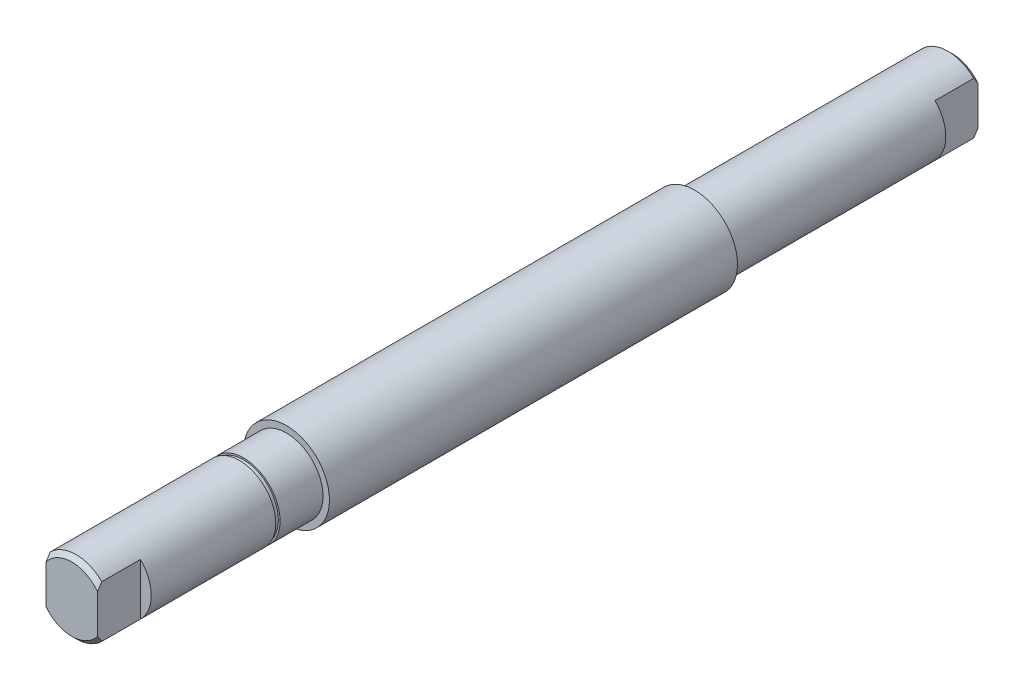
ISO-10303-21;
HEADER;
FILE_DESCRIPTION(('STEP AP214'),'2;1');
FILE_NAME('part.step','',(''),(''),'','','');
FILE_SCHEMA(('AUTOMOTIVE_DESIGN { 1 0 10303 214 1 1 1 1 }'));
ENDSEC;
DATA;
#1=APPLICATION_CONTEXT('core data for automotive mechanical design processes');
#2=APPLICATION_PROTOCOL_DEFINITION('international standard','automotive_design',2000,#1);
#3=PRODUCT_CONTEXT('',#1,'mechanical');
#4=PRODUCT('Part','Part','',(#3));
#5=PRODUCT_RELATED_PRODUCT_CATEGORY('part','',(#4));
#6=PRODUCT_DEFINITION_FORMATION('','',#4);
#7=PRODUCT_DEFINITION_CONTEXT('part definition',#1,'design');
#8=PRODUCT_DEFINITION('design','',#6,#7);
#9=PRODUCT_DEFINITION_SHAPE('','',#8);
#10=(LENGTH_UNIT() NAMED_UNIT(*) SI_UNIT(.MILLI.,.METRE.));
#11=(NAMED_UNIT(*) PLANE_ANGLE_UNIT() SI_UNIT($,.RADIAN.));
#12=(NAMED_UNIT(*) SI_UNIT($,.STERADIAN.) SOLID_ANGLE_UNIT());
#13=UNCERTAINTY_MEASURE_WITH_UNIT(LENGTH_MEASURE(1.E-05),#10,'distance_accuracy_value','');
#14=(GEOMETRIC_REPRESENTATION_CONTEXT(3) GLOBAL_UNCERTAINTY_ASSIGNED_CONTEXT((#13)) GLOBAL_UNIT_ASSIGNED_CONTEXT((#10,
#11,#12)) REPRESENTATION_CONTEXT('',''));
#15=CARTESIAN_POINT('',(0.,0.,0.));
#16=DIRECTION('',(0.,0.,1.));
#17=DIRECTION('',(1.,0.,0.));
#18=AXIS2_PLACEMENT_3D('',#15,#16,#17);
#19=CARTESIAN_POINT('',(0.,0.,205.));
#20=DIRECTION('',(0.,0.,-1.));
#21=DIRECTION('',(-1.,0.,0.));
#22=AXIS2_PLACEMENT_3D('',#19,#20,#21);
#23=CYLINDRICAL_SURFACE('',#22,8.5);
#24=CARTESIAN_POINT('',(0.,0.,155.));
#25=DIRECTION('',(0.,0.,1.));
#26=DIRECTION('',(1.,0.,0.));
#27=AXIS2_PLACEMENT_3D('',#24,#25,#26);
#28=CIRCLE('',#27,8.5);
#29=CARTESIAN_POINT('',(8.5,0.,155.));
#30=VERTEX_POINT('',#29);
#31=EDGE_CURVE('E193',#30,#30,#28,.T.);
#32=ORIENTED_EDGE('',*,*,#31,.T.);
#33=EDGE_LOOP('',(#32));
#34=FACE_BOUND('',#33,.T.);
#35=CARTESIAN_POINT('',(0.,0.,165.));
#36=DIRECTION('',(0.,0.,1.));
#37=DIRECTION('',(1.,0.,0.));
#38=AXIS2_PLACEMENT_3D('',#35,#36,#37);
#39=CIRCLE('',#38,8.5);
#40=CARTESIAN_POINT('',(8.5,0.,165.));
#41=VERTEX_POINT('',#40);
#42=EDGE_CURVE('E187',#41,#41,#39,.T.);
#43=ORIENTED_EDGE('',*,*,#42,.F.);
#44=EDGE_LOOP('',(#43));
#45=FACE_BOUND('',#44,.T.);
#46=ADVANCED_FACE('F29',(#34,#45),#23,.T.);
#47=CARTESIAN_POINT('',(0.,0.,155.));
#48=DIRECTION('',(0.,0.,1.));
#49=DIRECTION('',(1.,0.,0.));
#50=AXIS2_PLACEMENT_3D('',#47,#48,#49);
#51=PLANE('',#50);
#52=CARTESIAN_POINT('',(0.,0.,155.));
#53=DIRECTION('',(0.,0.,1.));
#54=DIRECTION('',(1.,0.,0.));
#55=AXIS2_PLACEMENT_3D('',#52,#53,#54);
#56=CIRCLE('',#55,10.);
#57=CARTESIAN_POINT('',(10.,0.,155.));
#58=VERTEX_POINT('',#57);
#59=EDGE_CURVE('E199',#58,#58,#56,.T.);
#60=ORIENTED_EDGE('',*,*,#59,.T.);
#61=EDGE_LOOP('',(#60));
#62=FACE_BOUND('',#61,.T.);
#63=ORIENTED_EDGE('',*,*,#31,.F.);
#64=EDGE_LOOP('',(#63));
#65=FACE_BOUND('',#64,.T.);
#66=ADVANCED_FACE('F309',(#62,#65),#51,.T.);
#67=CARTESIAN_POINT('',(0.,0.,60.));
#68=DIRECTION('',(0.,0.,-1.));
#69=DIRECTION('',(-1.,0.,0.));
#70=AXIS2_PLACEMENT_3D('',#67,#68,#69);
#71=CYLINDRICAL_SURFACE('',#70,8.5);
#72=CARTESIAN_POINT('',(0.,0.,60.));
#73=DIRECTION('',(0.,0.,1.));
#74=DIRECTION('',(1.,0.,0.));
#75=AXIS2_PLACEMENT_3D('',#72,#73,#74);
#76=CIRCLE('',#75,8.5);
#77=CARTESIAN_POINT('',(8.5,0.,60.));
#78=VERTEX_POINT('',#77);
#79=EDGE_CURVE('E202',#78,#78,#76,.T.);
#80=ORIENTED_EDGE('',*,*,#79,.F.);
#81=EDGE_LOOP('',(#80));
#82=FACE_BOUND('',#81,.T.);
#83=DIRECTION('',(0.,0.,-1.));
#84=VECTOR('',#83,1.);
#85=CARTESIAN_POINT('',(6.,6.02079728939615,10.));
#86=LINE('',#85,#84);
#87=CARTESIAN_POINT('',(6.,6.02079728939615,10.));
#88=VERTEX_POINT('',#87);
#89=CARTESIAN_POINT('',(6.,6.02079728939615,1.));
#90=VERTEX_POINT('',#89);
#91=EDGE_CURVE('E133',#88,#90,#86,.T.);
#92=ORIENTED_EDGE('',*,*,#91,.T.);
#93=CARTESIAN_POINT('',(0.,0.,1.));
#94=DIRECTION('',(0.,0.,1.));
#95=DIRECTION('',(1.,0.,0.));
#96=AXIS2_PLACEMENT_3D('',#93,#94,#95);
#97=CIRCLE('',#96,8.5);
#98=CARTESIAN_POINT('',(-6.,6.02079728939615,1.));
#99=VERTEX_POINT('',#98);
#100=EDGE_CURVE('E293',#90,#99,#97,.T.);
#101=ORIENTED_EDGE('',*,*,#100,.T.);
#102=DIRECTION('',(0.,0.,-1.));
#103=VECTOR('',#102,1.);
#104=CARTESIAN_POINT('',(-6.,6.02079728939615,10.));
#105=LINE('',#104,#103);
#106=CARTESIAN_POINT('',(-6.,6.02079728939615,10.));
#107=VERTEX_POINT('',#106);
#108=EDGE_CURVE('E150',#107,#99,#105,.T.);
#109=ORIENTED_EDGE('',*,*,#108,.F.);
#110=CARTESIAN_POINT('',(0.,0.,10.));
#111=DIRECTION('',(0.,0.,-1.));
#112=DIRECTION('',(-1.,0.,0.));
#113=AXIS2_PLACEMENT_3D('',#110,#111,#112);
#114=CIRCLE('',#113,8.5);
#115=CARTESIAN_POINT('',(-6.,-6.02079728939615,10.));
#116=VERTEX_POINT('',#115);
#117=EDGE_CURVE('E145',#116,#107,#114,.T.);
#118=ORIENTED_EDGE('',*,*,#117,.F.);
#119=DIRECTION('',(0.,0.,-1.));
#120=VECTOR('',#119,1.);
#121=CARTESIAN_POINT('',(-6.,-6.02079728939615,10.));
#122=LINE('',#121,#120);
#123=CARTESIAN_POINT('',(-6.,-6.02079728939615,1.));
#124=VERTEX_POINT('',#123);
#125=EDGE_CURVE('E151',#116,#124,#122,.T.);
#126=ORIENTED_EDGE('',*,*,#125,.T.);
#127=CARTESIAN_POINT('',(0.,0.,1.));
#128=DIRECTION('',(0.,0.,1.));
#129=DIRECTION('',(1.,0.,0.));
#130=AXIS2_PLACEMENT_3D('',#127,#128,#129);
#131=CIRCLE('',#130,8.5);
#132=CARTESIAN_POINT('',(6.,-6.02079728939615,1.));
#133=VERTEX_POINT('',#132);
#134=EDGE_CURVE('E138',#124,#133,#131,.T.);
#135=ORIENTED_EDGE('',*,*,#134,.T.);
#136=DIRECTION('',(0.,0.,-1.));
#137=VECTOR('',#136,1.);
#138=CARTESIAN_POINT('',(6.,-6.02079728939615,10.));
#139=LINE('',#138,#137);
#140=CARTESIAN_POINT('',(6.,-6.02079728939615,10.));
#141=VERTEX_POINT('',#140);
#142=EDGE_CURVE('E132',#141,#133,#139,.T.);
#143=ORIENTED_EDGE('',*,*,#142,.F.);
#144=CARTESIAN_POINT('',(0.,0.,10.));
#145=DIRECTION('',(0.,0.,-1.));
#146=DIRECTION('',(-1.,0.,0.));
#147=AXIS2_PLACEMENT_3D('',#144,#145,#146);
#148=CIRCLE('',#147,8.5);
#149=EDGE_CURVE('E122',#88,#141,#148,.T.);
#150=ORIENTED_EDGE('',*,*,#149,.F.);
#151=EDGE_LOOP('',(#92,#101,#109,#118,#126,#135,#143,#150));
#152=FACE_BOUND('',#151,.T.);
#153=ADVANCED_FACE('F31',(#82,#152),#71,.T.);
#154=CARTESIAN_POINT('',(0.,0.,0.));
#155=DIRECTION('',(0.,0.,1.));
#156=DIRECTION('',(1.,0.,0.));
#157=AXIS2_PLACEMENT_3D('',#154,#155,#156);
#158=PLANE('',#157);
#159=DIRECTION('',(0.,-1.,0.));
#160=VECTOR('',#159,1.);
#161=CARTESIAN_POINT('',(-6.,-6.02079728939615,0.));
#162=LINE('',#161,#160);
#163=CARTESIAN_POINT('',(-6.,4.49999999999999,0.));
#164=VERTEX_POINT('',#163);
#165=CARTESIAN_POINT('',(-6.,-4.49999999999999,0.));
#166=VERTEX_POINT('',#165);
#167=EDGE_CURVE('E140',#164,#166,#162,.T.);
#168=ORIENTED_EDGE('',*,*,#167,.F.);
#169=CARTESIAN_POINT('',(0.,0.,0.));
#170=DIRECTION('',(0.,0.,1.));
#171=DIRECTION('',(1.,0.,0.));
#172=AXIS2_PLACEMENT_3D('',#169,#170,#171);
#173=CIRCLE('',#172,7.5);
#174=CARTESIAN_POINT('',(6.,4.5,0.));
#175=VERTEX_POINT('',#174);
#176=EDGE_CURVE('E49',#164,#175,#173,.F.);
#177=ORIENTED_EDGE('',*,*,#176,.T.);
#178=DIRECTION('',(0.,1.,0.));
#179=VECTOR('',#178,1.);
#180=CARTESIAN_POINT('',(6.,6.02079728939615,0.));
#181=LINE('',#180,#179);
#182=CARTESIAN_POINT('',(6.,-4.49999999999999,0.));
#183=VERTEX_POINT('',#182);
#184=EDGE_CURVE('E129',#183,#175,#181,.T.);
#185=ORIENTED_EDGE('',*,*,#184,.F.);
#186=CARTESIAN_POINT('',(0.,0.,0.));
#187=DIRECTION('',(0.,0.,1.));
#188=DIRECTION('',(1.,0.,0.));
#189=AXIS2_PLACEMENT_3D('',#186,#187,#188);
#190=CIRCLE('',#189,7.5);
#191=EDGE_CURVE('E453',#183,#166,#190,.F.);
#192=ORIENTED_EDGE('',*,*,#191,.T.);
#193=EDGE_LOOP('',(#168,#177,#185,#192));
#194=FACE_BOUND('',#193,.T.);
#195=ADVANCED_FACE('F454',(#194),#158,.F.);
#196=CARTESIAN_POINT('',(0.,0.,60.));
#197=DIRECTION('',(0.,0.,1.));
#198=DIRECTION('',(1.,0.,0.));
#199=AXIS2_PLACEMENT_3D('',#196,#197,#198);
#200=PLANE('',#199);
#201=CARTESIAN_POINT('',(0.,0.,60.));
#202=DIRECTION('',(0.,0.,1.));
#203=DIRECTION('',(1.,0.,0.));
#204=AXIS2_PLACEMENT_3D('',#201,#202,#203);
#205=CIRCLE('',#204,10.);
#206=CARTESIAN_POINT('',(10.,0.,60.));
#207=VERTEX_POINT('',#206);
#208=EDGE_CURVE('E196',#207,#207,#205,.T.);
#209=ORIENTED_EDGE('',*,*,#208,.F.);
#210=EDGE_LOOP('',(#209));
#211=FACE_BOUND('',#210,.T.);
#212=ORIENTED_EDGE('',*,*,#79,.T.);
#213=EDGE_LOOP('',(#212));
#214=FACE_BOUND('',#213,.T.);
#215=ADVANCED_FACE('F457',(#211,#214),#200,.F.);
#216=CARTESIAN_POINT('',(0.,0.,155.));
#217=DIRECTION('',(0.,0.,-1.));
#218=DIRECTION('',(-1.,0.,0.));
#219=AXIS2_PLACEMENT_3D('',#216,#217,#218);
#220=CYLINDRICAL_SURFACE('',#219,10.);
#221=ORIENTED_EDGE('',*,*,#59,.F.);
#222=EDGE_LOOP('',(#221));
#223=FACE_BOUND('',#222,.T.);
#224=ORIENTED_EDGE('',*,*,#208,.T.);
#225=EDGE_LOOP('',(#224));
#226=FACE_BOUND('',#225,.T.);
#227=ADVANCED_FACE('F337',(#223,#226),#220,.T.);
#228=CARTESIAN_POINT('',(0.,0.,166.));
#229=DIRECTION('',(0.,0.,1.));
#230=DIRECTION('',(1.,0.,0.));
#231=AXIS2_PLACEMENT_3D('',#228,#229,#230);
#232=PLANE('',#231);
#233=CARTESIAN_POINT('',(0.,0.,166.));
#234=DIRECTION('',(0.,0.,1.));
#235=DIRECTION('',(1.,0.,0.));
#236=AXIS2_PLACEMENT_3D('',#233,#234,#235);
#237=CIRCLE('',#236,8.5);
#238=CARTESIAN_POINT('',(8.5,0.,166.));
#239=VERTEX_POINT('',#238);
#240=EDGE_CURVE('E190',#239,#239,#237,.T.);
#241=ORIENTED_EDGE('',*,*,#240,.F.);
#242=EDGE_LOOP('',(#241));
#243=FACE_BOUND('',#242,.T.);
#244=CARTESIAN_POINT('',(0.,0.,166.));
#245=DIRECTION('',(0.,0.,1.));
#246=DIRECTION('',(1.,0.,0.));
#247=AXIS2_PLACEMENT_3D('',#244,#245,#246);
#248=CIRCLE('',#247,8.1);
#249=CARTESIAN_POINT('',(8.1,0.,166.));
#250=VERTEX_POINT('',#249);
#251=EDGE_CURVE('E184',#250,#250,#248,.T.);
#252=ORIENTED_EDGE('',*,*,#251,.T.);
#253=EDGE_LOOP('',(#252));
#254=FACE_BOUND('',#253,.T.);
#255=ADVANCED_FACE('F333',(#243,#254),#232,.F.);
#256=CARTESIAN_POINT('',(0.,0.,165.));
#257=DIRECTION('',(0.,0.,1.));
#258=DIRECTION('',(1.,0.,0.));
#259=AXIS2_PLACEMENT_3D('',#256,#257,#258);
#260=PLANE('',#259);
#261=ORIENTED_EDGE('',*,*,#42,.T.);
#262=EDGE_LOOP('',(#261));
#263=FACE_BOUND('',#262,.T.);
#264=CARTESIAN_POINT('',(0.,0.,165.));
#265=DIRECTION('',(0.,0.,1.));
#266=DIRECTION('',(1.,0.,0.));
#267=AXIS2_PLACEMENT_3D('',#264,#265,#266);
#268=CIRCLE('',#267,8.1);
#269=CARTESIAN_POINT('',(8.1,0.,165.));
#270=VERTEX_POINT('',#269);
#271=EDGE_CURVE('E179',#270,#270,#268,.T.);
#272=ORIENTED_EDGE('',*,*,#271,.F.);
#273=EDGE_LOOP('',(#272));
#274=FACE_BOUND('',#273,.T.);
#275=ADVANCED_FACE('F336',(#263,#274),#260,.T.);
#276=CARTESIAN_POINT('',(0.,0.,166.));
#277=DIRECTION('',(0.,0.,-1.));
#278=DIRECTION('',(-1.,0.,0.));
#279=AXIS2_PLACEMENT_3D('',#276,#277,#278);
#280=CYLINDRICAL_SURFACE('',#279,8.1);
#281=ORIENTED_EDGE('',*,*,#251,.F.);
#282=EDGE_LOOP('',(#281));
#283=FACE_BOUND('',#282,.T.);
#284=ORIENTED_EDGE('',*,*,#271,.T.);
#285=EDGE_LOOP('',(#284));
#286=FACE_BOUND('',#285,.T.);
#287=ADVANCED_FACE('F245',(#283,#286),#280,.T.);
#288=CARTESIAN_POINT('',(0.,0.,205.));
#289=DIRECTION('',(0.,0.,1.));
#290=DIRECTION('',(1.,0.,0.));
#291=AXIS2_PLACEMENT_3D('',#288,#289,#290);
#292=PLANE('',#291);
#293=DIRECTION('',(0.,1.,0.));
#294=VECTOR('',#293,1.);
#295=CARTESIAN_POINT('',(-6.,6.02079728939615,205.));
#296=LINE('',#295,#294);
#297=CARTESIAN_POINT('',(-6.,-4.49999999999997,205.));
#298=VERTEX_POINT('',#297);
#299=CARTESIAN_POINT('',(-6.,4.49999999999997,205.));
#300=VERTEX_POINT('',#299);
#301=EDGE_CURVE('E166',#298,#300,#296,.T.);
#302=ORIENTED_EDGE('',*,*,#301,.F.);
#303=CARTESIAN_POINT('',(0.,0.,205.));
#304=DIRECTION('',(0.,0.,1.));
#305=DIRECTION('',(1.,0.,0.));
#306=AXIS2_PLACEMENT_3D('',#303,#304,#305);
#307=CIRCLE('',#306,7.49999999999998);
#308=CARTESIAN_POINT('',(6.,-4.49999999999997,205.));
#309=VERTEX_POINT('',#308);
#310=EDGE_CURVE('E208',#298,#309,#307,.T.);
#311=ORIENTED_EDGE('',*,*,#310,.T.);
#312=DIRECTION('',(0.,-1.,0.));
#313=VECTOR('',#312,1.);
#314=CARTESIAN_POINT('',(6.,6.02079728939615,205.));
#315=LINE('',#314,#313);
#316=CARTESIAN_POINT('',(6.,4.49999999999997,205.));
#317=VERTEX_POINT('',#316);
#318=EDGE_CURVE('E153',#317,#309,#315,.T.);
#319=ORIENTED_EDGE('',*,*,#318,.F.);
#320=CARTESIAN_POINT('',(0.,0.,205.));
#321=DIRECTION('',(0.,0.,1.));
#322=DIRECTION('',(1.,0.,0.));
#323=AXIS2_PLACEMENT_3D('',#320,#321,#322);
#324=CIRCLE('',#323,7.49999999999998);
#325=EDGE_CURVE('E205',#317,#300,#324,.T.);
#326=ORIENTED_EDGE('',*,*,#325,.T.);
#327=EDGE_LOOP('',(#302,#311,#319,#326));
#328=FACE_BOUND('',#327,.T.);
#329=ADVANCED_FACE('F321',(#328),#292,.T.);
#330=DIRECTION('',(0.,0.,1.));
#331=VECTOR('',#330,1.);
#332=CARTESIAN_POINT('',(6.,-6.02079728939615,195.));
#333=LINE('',#332,#331);
#334=CARTESIAN_POINT('',(6.,-6.02079728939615,195.));
#335=VERTEX_POINT('',#334);
#336=CARTESIAN_POINT('',(6.,-6.02079728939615,204.));
#337=VERTEX_POINT('',#336);
#338=EDGE_CURVE('E163',#335,#337,#333,.T.);
#339=ORIENTED_EDGE('',*,*,#338,.T.);
#340=CARTESIAN_POINT('',(0.,0.,204.));
#341=DIRECTION('',(0.,0.,1.));
#342=DIRECTION('',(1.,0.,0.));
#343=AXIS2_PLACEMENT_3D('',#340,#341,#342);
#344=CIRCLE('',#343,8.5);
#345=CARTESIAN_POINT('',(-6.,-6.02079728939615,204.));
#346=VERTEX_POINT('',#345);
#347=EDGE_CURVE('E521',#337,#346,#344,.F.);
#348=ORIENTED_EDGE('',*,*,#347,.T.);
#349=DIRECTION('',(0.,0.,1.));
#350=VECTOR('',#349,1.);
#351=CARTESIAN_POINT('',(-6.,-6.02079728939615,195.));
#352=LINE('',#351,#350);
#353=CARTESIAN_POINT('',(-6.,-6.02079728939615,195.));
#354=VERTEX_POINT('',#353);
#355=EDGE_CURVE('E175',#354,#346,#352,.T.);
#356=ORIENTED_EDGE('',*,*,#355,.F.);
#357=CARTESIAN_POINT('',(0.,0.,195.));
#358=DIRECTION('',(0.,0.,1.));
#359=DIRECTION('',(1.,0.,0.));
#360=AXIS2_PLACEMENT_3D('',#357,#358,#359);
#361=CIRCLE('',#360,8.5);
#362=CARTESIAN_POINT('',(-6.,6.02079728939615,195.));
#363=VERTEX_POINT('',#362);
#364=EDGE_CURVE('E171',#363,#354,#361,.T.);
#365=ORIENTED_EDGE('',*,*,#364,.F.);
#366=DIRECTION('',(0.,0.,1.));
#367=VECTOR('',#366,1.);
#368=CARTESIAN_POINT('',(-6.,6.02079728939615,195.));
#369=LINE('',#368,#367);
#370=CARTESIAN_POINT('',(-6.,6.02079728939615,204.));
#371=VERTEX_POINT('',#370);
#372=EDGE_CURVE('E176',#363,#371,#369,.T.);
#373=ORIENTED_EDGE('',*,*,#372,.T.);
#374=CARTESIAN_POINT('',(0.,0.,204.));
#375=DIRECTION('',(0.,0.,1.));
#376=DIRECTION('',(1.,0.,0.));
#377=AXIS2_PLACEMENT_3D('',#374,#375,#376);
#378=CIRCLE('',#377,8.5);
#379=CARTESIAN_POINT('',(6.,6.02079728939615,204.));
#380=VERTEX_POINT('',#379);
#381=EDGE_CURVE('E514',#371,#380,#378,.F.);
#382=ORIENTED_EDGE('',*,*,#381,.T.);
#383=DIRECTION('',(0.,0.,1.));
#384=VECTOR('',#383,1.);
#385=CARTESIAN_POINT('',(6.,6.02079728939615,195.));
#386=LINE('',#385,#384);
#387=CARTESIAN_POINT('',(6.,6.02079728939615,195.));
#388=VERTEX_POINT('',#387);
#389=EDGE_CURVE('E162',#388,#380,#386,.T.);
#390=ORIENTED_EDGE('',*,*,#389,.F.);
#391=CARTESIAN_POINT('',(0.,0.,195.));
#392=DIRECTION('',(0.,0.,1.));
#393=DIRECTION('',(1.,0.,0.));
#394=AXIS2_PLACEMENT_3D('',#391,#392,#393);
#395=CIRCLE('',#394,8.5);
#396=EDGE_CURVE('E158',#335,#388,#395,.T.);
#397=ORIENTED_EDGE('',*,*,#396,.F.);
#398=EDGE_LOOP('',(#339,#348,#356,#365,#373,#382,#390,#397));
#399=FACE_BOUND('',#398,.T.);
#400=ORIENTED_EDGE('',*,*,#240,.T.);
#401=EDGE_LOOP('',(#400));
#402=FACE_BOUND('',#401,.T.);
#403=ADVANCED_FACE('F243',(#399,#402),#23,.T.);
#404=CARTESIAN_POINT('',(-6.,6.02079728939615,195.));
#405=DIRECTION('',(1.,0.,0.));
#406=DIRECTION('',(0.,1.,0.));
#407=AXIS2_PLACEMENT_3D('',#404,#405,#406);
#408=PLANE('',#407);
#409=ORIENTED_EDGE('',*,*,#355,.T.);
#410=CARTESIAN_POINT('',(-6.,-6.02079728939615,204.));
#411=CARTESIAN_POINT('',(-6.,-5.89697637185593,204.087696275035));
#412=CARTESIAN_POINT('',(-6.,-5.77252449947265,204.174510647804));
#413=CARTESIAN_POINT('',(-6.,-5.52225339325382,204.346047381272));
#414=CARTESIAN_POINT('',(-6.,-5.39643466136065,204.430770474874));
#415=CARTESIAN_POINT('',(-6.,-5.14322797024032,204.597864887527));
#416=CARTESIAN_POINT('',(-6.,-5.01583990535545,204.680236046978));
#417=CARTESIAN_POINT('',(-6.,-4.75928582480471,204.842261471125));
#418=CARTESIAN_POINT('',(-6.,-4.63011919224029,204.921914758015));
#419=CARTESIAN_POINT('',(-6.,-4.49999999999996,205.));
#420=B_SPLINE_CURVE_WITH_KNOTS('',3,(#410,#411,#412,#413,#414,#415,#416,#417,#418,#419),
.UNSPECIFIED.,.F.,.F.,(4,2,2,2,4),(0.,0.455196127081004,0.910230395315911,1.36529546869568,
1.8205225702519),.UNSPECIFIED.);
#421=EDGE_CURVE('E255',#346,#298,#420,.T.);
#422=ORIENTED_EDGE('',*,*,#421,.T.);
#423=ORIENTED_EDGE('',*,*,#301,.T.);
#424=CARTESIAN_POINT('',(-6.,4.49999999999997,205.));
#425=CARTESIAN_POINT('',(-6.,4.63011919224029,204.921914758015));
#426=CARTESIAN_POINT('',(-6.,4.75928582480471,204.842261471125));
#427=CARTESIAN_POINT('',(-6.,5.01583990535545,204.680236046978));
#428=CARTESIAN_POINT('',(-6.,5.14322797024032,204.597864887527));
#429=CARTESIAN_POINT('',(-6.,5.39643466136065,204.430770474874));
#430=CARTESIAN_POINT('',(-6.,5.52225339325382,204.346047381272));
#431=CARTESIAN_POINT('',(-6.,5.77252449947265,204.174510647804));
#432=CARTESIAN_POINT('',(-6.,5.89697637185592,204.087696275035));
#433=CARTESIAN_POINT('',(-6.,6.02079728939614,204.));
#434=B_SPLINE_CURVE_WITH_KNOTS('',3,(#424,#425,#426,#427,#428,#429,#430,#431,#432,#433),
.UNSPECIFIED.,.F.,.F.,(4,2,2,2,4),(0.,0.455227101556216,0.910292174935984,1.36532644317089,
1.82052257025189),.UNSPECIFIED.);
#435=EDGE_CURVE('E249',#300,#371,#434,.T.);
#436=ORIENTED_EDGE('',*,*,#435,.T.);
#437=ORIENTED_EDGE('',*,*,#372,.F.);
#438=DIRECTION('',(0.,1.,0.));
#439=VECTOR('',#438,1.);
#440=CARTESIAN_POINT('',(-6.,6.02079728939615,195.));
#441=LINE('',#440,#439);
#442=EDGE_CURVE('E173',#354,#363,#441,.T.);
#443=ORIENTED_EDGE('',*,*,#442,.F.);
#444=EDGE_LOOP('',(#409,#422,#423,#436,#437,#443));
#445=FACE_BOUND('',#444,.T.);
#446=ADVANCED_FACE('F238',(#445),#408,.F.);
#447=CARTESIAN_POINT('',(0.,0.,195.));
#448=DIRECTION('',(0.,0.,1.));
#449=DIRECTION('',(1.,0.,0.));
#450=AXIS2_PLACEMENT_3D('',#447,#448,#449);
#451=PLANE('',#450);
#452=ORIENTED_EDGE('',*,*,#364,.T.);
#453=ORIENTED_EDGE('',*,*,#442,.T.);
#454=EDGE_LOOP('',(#452,#453));
#455=FACE_BOUND('',#454,.T.);
#456=ADVANCED_FACE('F232',(#455),#451,.T.);
#457=CARTESIAN_POINT('',(6.,6.02079728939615,195.));
#458=DIRECTION('',(-1.,0.,0.));
#459=DIRECTION('',(0.,-1.,0.));
#460=AXIS2_PLACEMENT_3D('',#457,#458,#459);
#461=PLANE('',#460);
#462=ORIENTED_EDGE('',*,*,#318,.T.);
#463=CARTESIAN_POINT('',(6.,-4.49999999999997,205.));
#464=CARTESIAN_POINT('',(6.,-4.63011919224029,204.921914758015));
#465=CARTESIAN_POINT('',(6.,-4.75928582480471,204.842261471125));
#466=CARTESIAN_POINT('',(6.,-5.01583990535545,204.680236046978));
#467=CARTESIAN_POINT('',(6.,-5.14322797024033,204.597864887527));
#468=CARTESIAN_POINT('',(6.,-5.39643466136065,204.430770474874));
#469=CARTESIAN_POINT('',(6.,-5.52225339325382,204.346047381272));
#470=CARTESIAN_POINT('',(6.,-5.77252449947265,204.174510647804));
#471=CARTESIAN_POINT('',(6.,-5.89697637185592,204.087696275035));
#472=CARTESIAN_POINT('',(6.,-6.02079728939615,204.));
#473=B_SPLINE_CURVE_WITH_KNOTS('',3,(#463,#464,#465,#466,#467,#468,#469,#470,#471,#472),
.UNSPECIFIED.,.F.,.F.,(4,2,2,2,4),(0.,0.455227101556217,0.910292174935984,1.36532644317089,
1.82052257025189),.UNSPECIFIED.);
#474=EDGE_CURVE('E218',#309,#337,#473,.T.);
#475=ORIENTED_EDGE('',*,*,#474,.T.);
#476=ORIENTED_EDGE('',*,*,#338,.F.);
#477=DIRECTION('',(0.,-1.,0.));
#478=VECTOR('',#477,1.);
#479=CARTESIAN_POINT('',(6.,6.02079728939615,195.));
#480=LINE('',#479,#478);
#481=EDGE_CURVE('E160',#388,#335,#480,.T.);
#482=ORIENTED_EDGE('',*,*,#481,.F.);
#483=ORIENTED_EDGE('',*,*,#389,.T.);
#484=CARTESIAN_POINT('',(6.,6.02079728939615,204.));
#485=CARTESIAN_POINT('',(6.,5.89697637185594,204.087696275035));
#486=CARTESIAN_POINT('',(6.,5.77252449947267,204.174510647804));
#487=CARTESIAN_POINT('',(6.,5.52225339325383,204.346047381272));
#488=CARTESIAN_POINT('',(6.,5.39643466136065,204.430770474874));
#489=CARTESIAN_POINT('',(6.,5.14322797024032,204.597864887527));
#490=CARTESIAN_POINT('',(6.,5.01583990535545,204.680236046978));
#491=CARTESIAN_POINT('',(6.,4.75928582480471,204.842261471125));
#492=CARTESIAN_POINT('',(6.,4.63011919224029,204.921914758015));
#493=CARTESIAN_POINT('',(6.,4.49999999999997,205.));
#494=B_SPLINE_CURVE_WITH_KNOTS('',3,(#484,#485,#486,#487,#488,#489,#490,#491,#492,#493),
.UNSPECIFIED.,.F.,.F.,(4,2,2,2,4),(0.,0.455196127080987,0.910230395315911,1.36529546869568,
1.8205225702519),.UNSPECIFIED.);
#495=EDGE_CURVE('E211',#380,#317,#494,.T.);
#496=ORIENTED_EDGE('',*,*,#495,.T.);
#497=EDGE_LOOP('',(#462,#475,#476,#482,#483,#496));
#498=FACE_BOUND('',#497,.T.);
#499=ADVANCED_FACE('F226',(#498),#461,.F.);
#500=CARTESIAN_POINT('',(0.,0.,195.));
#501=DIRECTION('',(0.,0.,1.));
#502=DIRECTION('',(1.,0.,0.));
#503=AXIS2_PLACEMENT_3D('',#500,#501,#502);
#504=PLANE('',#503);
#505=ORIENTED_EDGE('',*,*,#396,.T.);
#506=ORIENTED_EDGE('',*,*,#481,.T.);
#507=EDGE_LOOP('',(#505,#506));
#508=FACE_BOUND('',#507,.T.);
#509=ADVANCED_FACE('F231',(#508),#504,.T.);
#510=CARTESIAN_POINT('',(-6.,-6.02079728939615,10.));
#511=DIRECTION('',(1.,0.,0.));
#512=DIRECTION('',(0.,1.,0.));
#513=AXIS2_PLACEMENT_3D('',#510,#511,#512);
#514=PLANE('',#513);
#515=ORIENTED_EDGE('',*,*,#108,.T.);
#516=CARTESIAN_POINT('',(-6.,6.02079728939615,1.));
#517=CARTESIAN_POINT('',(-6.,5.89697637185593,0.91230372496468));
#518=CARTESIAN_POINT('',(-6.,5.77252449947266,0.825489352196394));
#519=CARTESIAN_POINT('',(-6.,5.52225339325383,0.653952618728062));
#520=CARTESIAN_POINT('',(-6.,5.39643466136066,0.569229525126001));
#521=CARTESIAN_POINT('',(-6.,5.14322797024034,0.40213511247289));
#522=CARTESIAN_POINT('',(-6.,5.01583990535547,0.319763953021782));
#523=CARTESIAN_POINT('',(-6.,4.75928582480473,0.157738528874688));
#524=CARTESIAN_POINT('',(-6.,4.63011919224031,0.0780852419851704));
#525=CARTESIAN_POINT('',(-6.,4.49999999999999,0.));
#526=B_SPLINE_CURVE_WITH_KNOTS('',3,(#516,#517,#518,#519,#520,#521,#522,#523,#524,#525),
.UNSPECIFIED.,.F.,.F.,(4,2,2,2,4),(0.,0.455196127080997,0.910230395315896,1.36529546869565,
1.82052257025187),.UNSPECIFIED.);
#527=EDGE_CURVE('E292',#99,#164,#526,.T.);
#528=ORIENTED_EDGE('',*,*,#527,.T.);
#529=ORIENTED_EDGE('',*,*,#167,.T.);
#530=CARTESIAN_POINT('',(-6.,-4.49999999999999,0.));
#531=CARTESIAN_POINT('',(-6.,-4.63011919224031,0.0780852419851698));
#532=CARTESIAN_POINT('',(-6.,-4.75928582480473,0.157738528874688));
#533=CARTESIAN_POINT('',(-6.,-5.01583990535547,0.319763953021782));
#534=CARTESIAN_POINT('',(-6.,-5.14322797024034,0.40213511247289));
#535=CARTESIAN_POINT('',(-6.,-5.39643466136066,0.569229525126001));
#536=CARTESIAN_POINT('',(-6.,-5.52225339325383,0.653952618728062));
#537=CARTESIAN_POINT('',(-6.,-5.77252449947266,0.825489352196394));
#538=CARTESIAN_POINT('',(-6.,-5.89697637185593,0.91230372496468));
#539=CARTESIAN_POINT('',(-6.,-6.02079728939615,1.));
#540=B_SPLINE_CURVE_WITH_KNOTS('',3,(#530,#531,#532,#533,#534,#535,#536,#537,#538,#539),
.UNSPECIFIED.,.F.,.F.,(4,2,2,2,4),(0.,0.455227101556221,0.910292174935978,1.36532644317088,
1.82052257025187),.UNSPECIFIED.);
#541=EDGE_CURVE('E287',#166,#124,#540,.T.);
#542=ORIENTED_EDGE('',*,*,#541,.T.);
#543=ORIENTED_EDGE('',*,*,#125,.F.);
#544=DIRECTION('',(0.,-1.,0.));
#545=VECTOR('',#544,1.);
#546=CARTESIAN_POINT('',(-6.,-6.02079728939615,10.));
#547=LINE('',#546,#545);
#548=EDGE_CURVE('E147',#107,#116,#547,.T.);
#549=ORIENTED_EDGE('',*,*,#548,.F.);
#550=EDGE_LOOP('',(#515,#528,#529,#542,#543,#549));
#551=FACE_BOUND('',#550,.T.);
#552=ADVANCED_FACE('F297',(#551),#514,.F.);
#553=CARTESIAN_POINT('',(0.,0.,10.));
#554=DIRECTION('',(0.,0.,-1.));
#555=DIRECTION('',(-1.,0.,0.));
#556=AXIS2_PLACEMENT_3D('',#553,#554,#555);
#557=PLANE('',#556);
#558=ORIENTED_EDGE('',*,*,#117,.T.);
#559=ORIENTED_EDGE('',*,*,#548,.T.);
#560=EDGE_LOOP('',(#558,#559));
#561=FACE_BOUND('',#560,.T.);
#562=ADVANCED_FACE('F271',(#561),#557,.T.);
#563=CARTESIAN_POINT('',(6.,6.02079728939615,10.));
#564=DIRECTION('',(-1.,0.,0.));
#565=DIRECTION('',(0.,-1.,0.));
#566=AXIS2_PLACEMENT_3D('',#563,#564,#565);
#567=PLANE('',#566);
#568=ORIENTED_EDGE('',*,*,#184,.T.);
#569=CARTESIAN_POINT('',(6.,4.5,0.));
#570=CARTESIAN_POINT('',(6.,4.63011919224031,0.0780852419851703));
#571=CARTESIAN_POINT('',(6.,4.75928582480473,0.157738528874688));
#572=CARTESIAN_POINT('',(6.,5.01583990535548,0.319763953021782));
#573=CARTESIAN_POINT('',(6.,5.14322797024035,0.40213511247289));
#574=CARTESIAN_POINT('',(6.,5.39643466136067,0.569229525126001));
#575=CARTESIAN_POINT('',(6.,5.52225339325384,0.653952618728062));
#576=CARTESIAN_POINT('',(6.,5.77252449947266,0.825489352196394));
#577=CARTESIAN_POINT('',(6.,5.89697637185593,0.91230372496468));
#578=CARTESIAN_POINT('',(6.,6.02079728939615,1.));
#579=B_SPLINE_CURVE_WITH_KNOTS('',3,(#569,#570,#571,#572,#573,#574,#575,#576,#577,#578),
.UNSPECIFIED.,.F.,.F.,(4,2,2,2,4),(0.,0.455227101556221,0.910292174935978,1.36532644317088,
1.82052257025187),.UNSPECIFIED.);
#580=EDGE_CURVE('E11',#175,#90,#579,.T.);
#581=ORIENTED_EDGE('',*,*,#580,.T.);
#582=ORIENTED_EDGE('',*,*,#91,.F.);
#583=DIRECTION('',(0.,1.,0.));
#584=VECTOR('',#583,1.);
#585=CARTESIAN_POINT('',(6.,6.02079728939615,10.));
#586=LINE('',#585,#584);
#587=EDGE_CURVE('E125',#141,#88,#586,.T.);
#588=ORIENTED_EDGE('',*,*,#587,.F.);
#589=ORIENTED_EDGE('',*,*,#142,.T.);
#590=CARTESIAN_POINT('',(6.,-6.02079728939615,1.));
#591=CARTESIAN_POINT('',(6.,-5.89697637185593,0.91230372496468));
#592=CARTESIAN_POINT('',(6.,-5.77252449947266,0.825489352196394));
#593=CARTESIAN_POINT('',(6.,-5.52225339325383,0.653952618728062));
#594=CARTESIAN_POINT('',(6.,-5.39643466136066,0.569229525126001));
#595=CARTESIAN_POINT('',(6.,-5.14322797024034,0.40213511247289));
#596=CARTESIAN_POINT('',(6.,-5.01583990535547,0.319763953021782));
#597=CARTESIAN_POINT('',(6.,-4.75928582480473,0.157738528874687));
#598=CARTESIAN_POINT('',(6.,-4.63011919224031,0.0780852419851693));
#599=CARTESIAN_POINT('',(6.,-4.49999999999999,0.));
#600=B_SPLINE_CURVE_WITH_KNOTS('',3,(#590,#591,#592,#593,#594,#595,#596,#597,#598,#599),
.UNSPECIFIED.,.F.,.F.,(4,2,2,2,4),(0.,0.455196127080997,0.910230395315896,1.36529546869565,
1.82052257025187),.UNSPECIFIED.);
#601=EDGE_CURVE('E42',#133,#183,#600,.T.);
#602=ORIENTED_EDGE('',*,*,#601,.T.);
#603=EDGE_LOOP('',(#568,#581,#582,#588,#589,#602));
#604=FACE_BOUND('',#603,.T.);
#605=ADVANCED_FACE('F131',(#604),#567,.F.);
#606=CARTESIAN_POINT('',(0.,0.,10.));
#607=DIRECTION('',(0.,0.,-1.));
#608=DIRECTION('',(-1.,0.,0.));
#609=AXIS2_PLACEMENT_3D('',#606,#607,#608);
#610=PLANE('',#609);
#611=ORIENTED_EDGE('',*,*,#149,.T.);
#612=ORIENTED_EDGE('',*,*,#587,.T.);
#613=EDGE_LOOP('',(#611,#612));
#614=FACE_BOUND('',#613,.T.);
#615=ADVANCED_FACE('F124',(#614),#610,.T.);
#616=CARTESIAN_POINT('',(0.,0.,205.));
#617=DIRECTION('',(0.,0.,-1.));
#618=DIRECTION('',(-1.,0.,0.));
#619=AXIS2_PLACEMENT_3D('',#616,#617,#618);
#620=CONICAL_SURFACE('',#619,7.49999999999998,0.785398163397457);
#621=ORIENTED_EDGE('',*,*,#421,.F.);
#622=ORIENTED_EDGE('',*,*,#347,.F.);
#623=ORIENTED_EDGE('',*,*,#474,.F.);
#624=ORIENTED_EDGE('',*,*,#310,.F.);
#625=EDGE_LOOP('',(#621,#622,#623,#624));
#626=FACE_BOUND('',#625,.T.);
#627=ADVANCED_FACE('F261',(#626),#620,.T.);
#628=CARTESIAN_POINT('',(0.,0.,205.));
#629=DIRECTION('',(0.,0.,-1.));
#630=DIRECTION('',(-1.,0.,0.));
#631=AXIS2_PLACEMENT_3D('',#628,#629,#630);
#632=CONICAL_SURFACE('',#631,7.49999999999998,0.785398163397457);
#633=ORIENTED_EDGE('',*,*,#495,.F.);
#634=ORIENTED_EDGE('',*,*,#381,.F.);
#635=ORIENTED_EDGE('',*,*,#435,.F.);
#636=ORIENTED_EDGE('',*,*,#325,.F.);
#637=EDGE_LOOP('',(#633,#634,#635,#636));
#638=FACE_BOUND('',#637,.T.);
#639=ADVANCED_FACE('F224',(#638),#632,.T.);
#640=CARTESIAN_POINT('',(0.,0.,1.));
#641=DIRECTION('',(0.,0.,1.));
#642=DIRECTION('',(1.,0.,0.));
#643=AXIS2_PLACEMENT_3D('',#640,#641,#642);
#644=CONICAL_SURFACE('',#643,8.5,0.78539816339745);
#645=ORIENTED_EDGE('',*,*,#580,.F.);
#646=ORIENTED_EDGE('',*,*,#176,.F.);
#647=ORIENTED_EDGE('',*,*,#527,.F.);
#648=ORIENTED_EDGE('',*,*,#100,.F.);
#649=EDGE_LOOP('',(#645,#646,#647,#648));
#650=FACE_BOUND('',#649,.T.);
#651=ADVANCED_FACE('F282',(#650),#644,.T.);
#652=CARTESIAN_POINT('',(0.,0.,1.));
#653=DIRECTION('',(0.,0.,1.));
#654=DIRECTION('',(1.,0.,0.));
#655=AXIS2_PLACEMENT_3D('',#652,#653,#654);
#656=CONICAL_SURFACE('',#655,8.5,0.78539816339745);
#657=ORIENTED_EDGE('',*,*,#541,.F.);
#658=ORIENTED_EDGE('',*,*,#191,.F.);
#659=ORIENTED_EDGE('',*,*,#601,.F.);
#660=ORIENTED_EDGE('',*,*,#134,.F.);
#661=EDGE_LOOP('',(#657,#658,#659,#660));
#662=FACE_BOUND('',#661,.T.);
#663=ADVANCED_FACE('F279',(#662),#656,.T.);
#664=CLOSED_SHELL('',(#46,#66,#153,#195,#215,#227,#255,#275,#287,#329,#403,#446,#456,#499,#509,
#552,#562,#605,#615,#627,#639,#651,#663));
#665=MANIFOLD_SOLID_BREP('B2',#664);
#666=ADVANCED_BREP_SHAPE_REPRESENTATION('',(#18,#665),#14);
#667=SHAPE_DEFINITION_REPRESENTATION(#9,#666);
ENDSEC;
END-ISO-10303-21;
